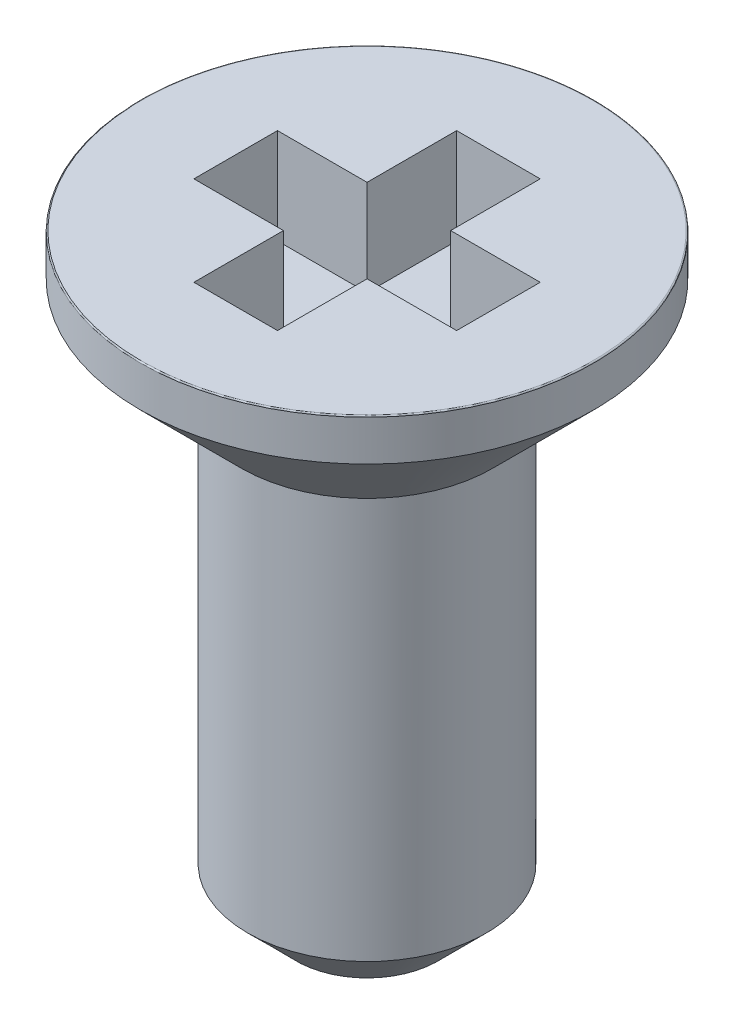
from build123d import *

# Parameters (mm, degrees)
SKETCH2_W               = 0.7
SKETCH2_H               = 2.2
CUT_EXTRUDE_THIN2_DEPTH = 0.8
CIRPATTERN1_COUNT       = 2
CIRPATTERN1_ANGLE       = 90
SKETCH3_R               = 1
BOSS_EXTRUDE1_DEPTH     = 3.8
CHAMFER1_SIZE           = 0.4064
CHAMFER2_SIZE           = 0.85


with BuildPart() as part:
    # Sketch1 → Base-Revolve (revolve)
    with BuildSketch(Plane.XY, mode=Mode.PRIVATE) as base_revolve_sk:
        with BuildLine():
            Line((1.9, 0), (0, 0))
            Line((0, 0), (0, 1.2))
            Line((0, 1.2), (1.89, 1.2))
            ThreePointArc((1.89, 1.2), (1.897071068, 1.197071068), (1.9, 1.19))
            Line((1.9, 1.19), (1.9, 0))
        make_face()
    revolve(base_revolve_sk.sketch.rotate(Axis((0, 11.592517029, 0), (0, -1, 0)), 90), axis=Axis((0, 11.592517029, 0), (0, -1, 0)))

    # Sketch2 → Cut-Extrude-Thin2 (cut)
    with BuildSketch(Plane(origin=(0, 1.2, 0), x_dir=(-1, 0, 0), z_dir=(0, 1, 0))):
        Rectangle(SKETCH2_W, SKETCH2_H)
    cut_extrude_thin2 = extrude(amount=-CUT_EXTRUDE_THIN2_DEPTH, mode=Mode.SUBTRACT)

    # CirPattern1: Cut-Extrude-Thin2 ×2 about axis
    cirpattern1_axis = Axis((0, 0, 0), (0, 1, 0))
    for i in range(1, CIRPATTERN1_COUNT):
        add(cut_extrude_thin2.rotate(cirpattern1_axis, i * CIRPATTERN1_ANGLE / (CIRPATTERN1_COUNT - 1)), mode=Mode.SUBTRACT)

    # Sketch3 → Boss-Extrude1 (add)
    with BuildSketch(Plane.XZ):
        with Locations(Location((0, 0, 0), (0, 0, 90))):
            Circle(SKETCH3_R)
    extrude(amount=BOSS_EXTRUDE1_DEPTH)

    # Chamfer1
    chamfer1_edges = [part.edges().sort_by_distance(p)[0] for p in [
        (0, -3.8, -1),
    ]]
    chamfer(chamfer1_edges, length=CHAMFER1_SIZE)

    # Chamfer2
    chamfer2_edges = [part.edges().sort_by_distance(p)[0] for p in [
        (0, 0, -1.9),
    ]]
    chamfer(chamfer2_edges, length=CHAMFER2_SIZE)


solid = part.part
